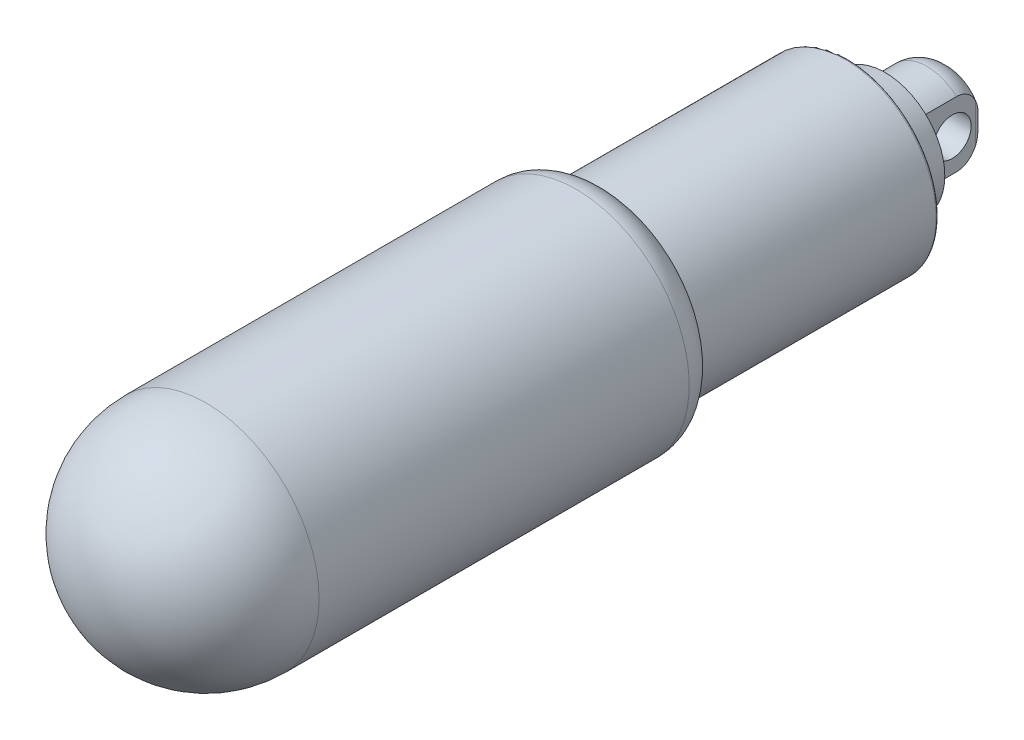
ISO-10303-21;
HEADER;
FILE_DESCRIPTION(('STEP AP214'),'2;1');
FILE_NAME('part.step','',(''),(''),'','','');
FILE_SCHEMA(('AUTOMOTIVE_DESIGN { 1 0 10303 214 1 1 1 1 }'));
ENDSEC;
DATA;
#1=APPLICATION_CONTEXT('core data for automotive mechanical design processes');
#2=APPLICATION_PROTOCOL_DEFINITION('international standard','automotive_design',2000,#1);
#3=PRODUCT_CONTEXT('',#1,'mechanical');
#4=PRODUCT('Part','Part','',(#3));
#5=PRODUCT_RELATED_PRODUCT_CATEGORY('part','',(#4));
#6=PRODUCT_DEFINITION_FORMATION('','',#4);
#7=PRODUCT_DEFINITION_CONTEXT('part definition',#1,'design');
#8=PRODUCT_DEFINITION('design','',#6,#7);
#9=PRODUCT_DEFINITION_SHAPE('','',#8);
#10=(LENGTH_UNIT() NAMED_UNIT(*) SI_UNIT(.MILLI.,.METRE.));
#11=(NAMED_UNIT(*) PLANE_ANGLE_UNIT() SI_UNIT($,.RADIAN.));
#12=(NAMED_UNIT(*) SI_UNIT($,.STERADIAN.) SOLID_ANGLE_UNIT());
#13=UNCERTAINTY_MEASURE_WITH_UNIT(LENGTH_MEASURE(1.E-05),#10,'distance_accuracy_value','');
#14=(GEOMETRIC_REPRESENTATION_CONTEXT(3) GLOBAL_UNCERTAINTY_ASSIGNED_CONTEXT((#13)) GLOBAL_UNIT_ASSIGNED_CONTEXT((#10,
#11,#12)) REPRESENTATION_CONTEXT('',''));
#15=CARTESIAN_POINT('',(0.,0.,0.));
#16=DIRECTION('',(0.,0.,1.));
#17=DIRECTION('',(1.,0.,0.));
#18=AXIS2_PLACEMENT_3D('',#15,#16,#17);
#19=CARTESIAN_POINT('',(0.,0.75,-2.3333333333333));
#20=DIRECTION('',(0.,0.,-1.));
#21=DIRECTION('',(0.,1.,0.));
#22=AXIS2_PLACEMENT_3D('',#19,#20,#21);
#23=PLANE('',#22);
#24=CARTESIAN_POINT('',(0.,0.,-2.3333333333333));
#25=DIRECTION('',(0.,0.,1.));
#26=DIRECTION('',(1.,0.,0.));
#27=AXIS2_PLACEMENT_3D('',#24,#25,#26);
#28=CIRCLE('',#27,1.5);
#29=CARTESIAN_POINT('',(1.5,0.,-2.3333333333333));
#30=VERTEX_POINT('',#29);
#31=CARTESIAN_POINT('',(0.,1.5,-2.3333333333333));
#32=VERTEX_POINT('',#31);
#33=EDGE_CURVE('E186',#30,#32,#28,.T.);
#34=ORIENTED_EDGE('',*,*,#33,.F.);
#35=CARTESIAN_POINT('',(0.,0.,-2.3333333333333));
#36=DIRECTION('',(0.,0.,1.));
#37=DIRECTION('',(-1.,0.,0.));
#38=AXIS2_PLACEMENT_3D('',#35,#36,#37);
#39=CIRCLE('',#38,1.5);
#40=CARTESIAN_POINT('',(-1.5,0.,-2.3333333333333));
#41=VERTEX_POINT('',#40);
#42=EDGE_CURVE('E81',#41,#30,#39,.T.);
#43=ORIENTED_EDGE('',*,*,#42,.F.);
#44=CARTESIAN_POINT('',(0.,0.,-2.3333333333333));
#45=DIRECTION('',(0.,0.,1.));
#46=DIRECTION('',(0.,1.,0.));
#47=AXIS2_PLACEMENT_3D('',#44,#45,#46);
#48=CIRCLE('',#47,1.5);
#49=EDGE_CURVE('E182',#32,#41,#48,.T.);
#50=ORIENTED_EDGE('',*,*,#49,.F.);
#51=EDGE_LOOP('',(#34,#43,#50));
#52=FACE_BOUND('',#51,.T.);
#53=ADVANCED_FACE('F14',(#52),#23,.T.);
#54=CARTESIAN_POINT('',(-1.85,-9.,-1.8333333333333));
#55=DIRECTION('',(0.,-1.,0.));
#56=DIRECTION('',(1.,0.,0.));
#57=AXIS2_PLACEMENT_3D('',#54,#55,#56);
#58=CYLINDRICAL_SURFACE('',#57,0.500000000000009);
#59=DIRECTION('',(0.,1.,0.));
#60=VECTOR('',#59,1.);
#61=CARTESIAN_POINT('',(-2.35,-9.,-1.8333333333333));
#62=LINE('',#61,#60);
#63=CARTESIAN_POINT('',(-2.35,-1.5640098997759,-1.8333333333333));
#64=VERTEX_POINT('',#63);
#65=CARTESIAN_POINT('',(-2.35,1.5640098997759,-1.8333333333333));
#66=VERTEX_POINT('',#65);
#67=EDGE_CURVE('E112',#64,#66,#62,.T.);
#68=ORIENTED_EDGE('',*,*,#67,.T.);
#69=CARTESIAN_POINT('',(-2.35,-1.5640098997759,-1.8333333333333));
#70=CARTESIAN_POINT('',(-2.35000059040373,-1.52921617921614,-1.85033683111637));
#71=CARTESIAN_POINT('',(-2.34913273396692,-1.49426464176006,-1.86699499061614));
#72=CARTESIAN_POINT('',(-2.34587423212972,-1.4240595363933,-1.89947718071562));
#73=CARTESIAN_POINT('',(-2.34348409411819,-1.38880607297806,-1.91530148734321));
#74=CARTESIAN_POINT('',(-2.33436002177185,-1.28269217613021,-1.96127595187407));
#75=CARTESIAN_POINT('',(-2.32567104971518,-1.21136632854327,-1.98998321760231));
#76=CARTESIAN_POINT('',(-2.30491634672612,-1.06739492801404,-2.0427532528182));
#77=CARTESIAN_POINT('',(-2.2928451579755,-0.994747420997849,-2.06680840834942));
#78=CARTESIAN_POINT('',(-2.26741048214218,-0.848150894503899,-2.10972121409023));
#79=CARTESIAN_POINT('',(-2.254047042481,-0.77420192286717,-2.1285790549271));
#80=CARTESIAN_POINT('',(-2.23371793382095,-0.656205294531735,-2.15412271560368));
#81=CARTESIAN_POINT('',(-2.22641554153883,-0.612597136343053,-2.16259953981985));
#82=CARTESIAN_POINT('',(-2.21262642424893,-0.524936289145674,-2.17772651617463));
#83=CARTESIAN_POINT('',(-2.2061396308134,-0.480883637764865,-2.18437682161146));
#84=CARTESIAN_POINT('',(-2.19444993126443,-0.392477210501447,-2.19585432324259));
#85=CARTESIAN_POINT('',(-2.18924403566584,-0.348124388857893,-2.20068577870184));
#86=CARTESIAN_POINT('',(-2.18049591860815,-0.259099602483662,-2.20857660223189));
#87=CARTESIAN_POINT('',(-2.17695342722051,-0.214427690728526,-2.21163625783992));
#88=CARTESIAN_POINT('',(-2.17276895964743,-0.141431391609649,-2.21520313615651));
#89=CARTESIAN_POINT('',(-2.17153891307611,-0.113164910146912,-2.2162357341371));
#90=CARTESIAN_POINT('',(-2.16989218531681,-0.0566002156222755,-2.21761158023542));
#91=CARTESIAN_POINT('',(-2.1694752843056,-0.0283020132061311,-2.2179550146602));
#92=CARTESIAN_POINT('',(-2.16948364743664,0.068259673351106,-2.21795563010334));
#93=CARTESIAN_POINT('',(-2.1719289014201,0.136541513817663,-2.21595938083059));
#94=CARTESIAN_POINT('',(-2.18123854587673,0.272585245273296,-2.20792078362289));
#95=CARTESIAN_POINT('',(-2.188106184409,0.340346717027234,-2.20187546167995));
#96=CARTESIAN_POINT('',(-2.2050464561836,0.475336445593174,-2.18558202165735));
#97=CARTESIAN_POINT('',(-2.21513705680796,0.542559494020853,-2.17531024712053));
#98=CARTESIAN_POINT('',(-2.23687971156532,0.675941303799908,-2.15050039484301));
#99=CARTESIAN_POINT('',(-2.24853171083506,0.742100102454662,-2.1359624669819));
#100=CARTESIAN_POINT('',(-2.27165531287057,0.872912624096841,-2.10279970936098));
#101=CARTESIAN_POINT('',(-2.28312760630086,0.937573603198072,-2.08420392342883));
#102=CARTESIAN_POINT('',(-2.30445804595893,1.06589445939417,-2.04310545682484));
#103=CARTESIAN_POINT('',(-2.31431668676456,1.12955463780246,-2.0206039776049));
#104=CARTESIAN_POINT('',(-2.33098930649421,1.25551542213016,-1.97224765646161));
#105=CARTESIAN_POINT('',(-2.33782319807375,1.3178222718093,-1.94641623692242));
#106=CARTESIAN_POINT('',(-2.3473395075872,1.44158364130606,-1.89187345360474));
#107=CARTESIAN_POINT('',(-2.35001595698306,1.50303681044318,-1.86315801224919));
#108=CARTESIAN_POINT('',(-2.35,1.5640098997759,-1.8333333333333));
#109=B_SPLINE_CURVE_WITH_KNOTS('',3,(#69,#70,#71,#72,#73,#74,#75,#76,#77,#78,#79,#80,#81,#82,
#83,#84,#85,#86,#87,#88,#89,#90,#91,#92,#93,#94,#95,#96,#97,#98,#99,#100,#101,#102,#103,#104,
#105,#106,#107,#108),.UNSPECIFIED.,.F.,.F.,(4,2,2,2,2,2,2,2,2,2,2,2,2,2,2,2,2,2,2,4),(0.,
0.116151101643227,0.232263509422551,0.464114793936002,0.696342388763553,0.928561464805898,
1.06358517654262,1.19859755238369,1.33329176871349,1.46796412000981,1.5528811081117,
1.63777513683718,1.84252518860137,2.04742579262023,2.25348922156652,2.45954541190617,
2.66417250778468,2.86873676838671,3.07193354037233,3.27542175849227),.UNSPECIFIED.);
#110=EDGE_CURVE('E80',#64,#66,#109,.T.);
#111=ORIENTED_EDGE('',*,*,#110,.F.);
#112=EDGE_LOOP('',(#68,#111));
#113=FACE_BOUND('',#112,.T.);
#114=ADVANCED_FACE('F227',(#113),#58,.T.);
#115=CARTESIAN_POINT('',(9.,0.,0.));
#116=DIRECTION('',(1.,0.,0.));
#117=DIRECTION('',(0.,1.,0.));
#118=AXIS2_PLACEMENT_3D('',#115,#116,#117);
#119=CYLINDRICAL_SURFACE('',#118,1.5);
#120=CARTESIAN_POINT('',(2.35,0.,0.));
#121=DIRECTION('',(1.,0.,0.));
#122=DIRECTION('',(0.,1.,0.));
#123=AXIS2_PLACEMENT_3D('',#120,#121,#122);
#124=CIRCLE('',#123,1.5);
#125=CARTESIAN_POINT('',(2.35,1.5,0.));
#126=VERTEX_POINT('',#125);
#127=EDGE_CURVE('E92',#126,#126,#124,.T.);
#128=ORIENTED_EDGE('',*,*,#127,.T.);
#129=EDGE_LOOP('',(#128));
#130=FACE_BOUND('',#129,.T.);
#131=CARTESIAN_POINT('',(-2.35,0.,0.));
#132=DIRECTION('',(1.,0.,0.));
#133=DIRECTION('',(0.,1.,0.));
#134=AXIS2_PLACEMENT_3D('',#131,#132,#133);
#135=CIRCLE('',#134,1.5);
#136=CARTESIAN_POINT('',(-2.35,1.5,0.));
#137=VERTEX_POINT('',#136);
#138=EDGE_CURVE('E218',#137,#137,#135,.F.);
#139=ORIENTED_EDGE('',*,*,#138,.T.);
#140=EDGE_LOOP('',(#139));
#141=FACE_BOUND('',#140,.T.);
#142=ADVANCED_FACE('F241',(#130,#141),#119,.F.);
#143=CARTESIAN_POINT('',(1.85,-9.,-1.8333333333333));
#144=DIRECTION('',(0.,-1.,0.));
#145=DIRECTION('',(1.,0.,0.));
#146=AXIS2_PLACEMENT_3D('',#143,#144,#145);
#147=CYLINDRICAL_SURFACE('',#146,0.499999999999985);
#148=DIRECTION('',(0.,1.,0.));
#149=VECTOR('',#148,1.);
#150=CARTESIAN_POINT('',(2.35,-9.,-1.8333333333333));
#151=LINE('',#150,#149);
#152=CARTESIAN_POINT('',(2.35,1.5640098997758,-1.8333333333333));
#153=VERTEX_POINT('',#152);
#154=CARTESIAN_POINT('',(2.35,-1.56400989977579,-1.8333333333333));
#155=VERTEX_POINT('',#154);
#156=EDGE_CURVE('E77',#153,#155,#151,.F.);
#157=ORIENTED_EDGE('',*,*,#156,.T.);
#158=CARTESIAN_POINT('',(2.35,1.5640098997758,-1.8333333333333));
#159=CARTESIAN_POINT('',(2.35000059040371,1.52921617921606,-1.8503368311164));
#160=CARTESIAN_POINT('',(2.3491327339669,1.49426464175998,-1.86699499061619));
#161=CARTESIAN_POINT('',(2.34587423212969,1.42405953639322,-1.89947718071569));
#162=CARTESIAN_POINT('',(2.34348409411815,1.38880607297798,-1.91530148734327));
#163=CARTESIAN_POINT('',(2.33436002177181,1.28269217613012,-1.96127595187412));
#164=CARTESIAN_POINT('',(2.32567104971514,1.21136632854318,-1.98998321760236));
#165=CARTESIAN_POINT('',(2.30491634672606,1.06739492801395,-2.04275325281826));
#166=CARTESIAN_POINT('',(2.29284515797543,0.994747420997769,-2.06680840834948));
#167=CARTESIAN_POINT('',(2.26741048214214,0.848150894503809,-2.10972121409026));
#168=CARTESIAN_POINT('',(2.254047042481,0.774201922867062,-2.12857905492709));
#169=CARTESIAN_POINT('',(2.23371793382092,0.656205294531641,-2.15412271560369));
#170=CARTESIAN_POINT('',(2.22641554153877,0.612597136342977,-2.16259953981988));
#171=CARTESIAN_POINT('',(2.21262642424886,0.524936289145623,-2.17772651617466));
#172=CARTESIAN_POINT('',(2.20613963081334,0.480883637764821,-2.18437682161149));
#173=CARTESIAN_POINT('',(2.19444993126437,0.39247721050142,-2.19585432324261));
#174=CARTESIAN_POINT('',(2.18924403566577,0.348124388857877,-2.20068577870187));
#175=CARTESIAN_POINT('',(2.1804959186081,0.259099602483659,-2.20857660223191));
#176=CARTESIAN_POINT('',(2.1769534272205,0.214427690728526,-2.21163625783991));
#177=CARTESIAN_POINT('',(2.17276895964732,0.141431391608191,-2.21520313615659));
#178=CARTESIAN_POINT('',(2.17153891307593,0.113164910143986,-2.21623573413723));
#179=CARTESIAN_POINT('',(2.16989218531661,0.0566002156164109,-2.21761158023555));
#180=CARTESIAN_POINT('',(2.16947528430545,0.0283020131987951,-2.21795501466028));
#181=CARTESIAN_POINT('',(2.1694836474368,-0.0682596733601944,-2.21795563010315));
#182=CARTESIAN_POINT('',(2.17192890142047,-0.13654151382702,-2.21595938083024));
#183=CARTESIAN_POINT('',(2.18123854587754,-0.27258524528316,-2.20792078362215));
#184=CARTESIAN_POINT('',(2.18810618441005,-0.340346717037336,-2.20187546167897));
#185=CARTESIAN_POINT('',(2.20504645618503,-0.475336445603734,-2.18558202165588));
#186=CARTESIAN_POINT('',(2.21513705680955,-0.542559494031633,-2.1753102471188));
#187=CARTESIAN_POINT('',(2.23687971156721,-0.675941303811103,-2.1505003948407));
#188=CARTESIAN_POINT('',(2.24853171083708,-0.742100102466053,-2.13596246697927));
#189=CARTESIAN_POINT('',(2.27165531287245,-0.87291262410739,-2.10279970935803));
#190=CARTESIAN_POINT('',(2.28312760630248,-0.937573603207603,-2.08420392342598));
#191=CARTESIAN_POINT('',(2.30445804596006,-1.06589445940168,-2.04310545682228));
#192=CARTESIAN_POINT('',(2.31431668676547,-1.12955463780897,-2.02060397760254));
#193=CARTESIAN_POINT('',(2.3309893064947,-1.25551542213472,-1.97224765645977));
#194=CARTESIAN_POINT('',(2.33782319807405,-1.31782227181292,-1.94641623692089));
#195=CARTESIAN_POINT('',(2.34733950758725,-1.44158364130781,-1.89187345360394));
#196=CARTESIAN_POINT('',(2.35001595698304,-1.503036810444,-1.86315801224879));
#197=CARTESIAN_POINT('',(2.35,-1.56400989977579,-1.8333333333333));
#198=B_SPLINE_CURVE_WITH_KNOTS('',3,(#158,#159,#160,#161,#162,#163,#164,#165,#166,#167,#168,
#169,#170,#171,#172,#173,#174,#175,#176,#177,#178,#179,#180,#181,#182,#183,#184,#185,#186,#187,
#188,#189,#190,#191,#192,#193,#194,#195,#196,#197),.UNSPECIFIED.,.F.,.F.,(4,2,2,2,2,2,2,2,2,2,2,
2,2,2,2,2,2,2,2,4),(0.,0.116151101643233,0.232263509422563,0.464114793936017,0.696342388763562,
0.928561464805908,1.06358517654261,1.19859755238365,1.33329176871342,1.46796412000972,
1.55288110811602,1.6377751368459,1.84252518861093,2.04742579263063,2.25348922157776,
2.45954541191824,2.66417250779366,2.8687367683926,3.07193354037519,3.2754217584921),.UNSPECIFIED.);
#199=EDGE_CURVE('E73',#153,#155,#198,.T.);
#200=ORIENTED_EDGE('',*,*,#199,.F.);
#201=EDGE_LOOP('',(#157,#200));
#202=FACE_BOUND('',#201,.T.);
#203=ADVANCED_FACE('F75',(#202),#147,.T.);
#204=CARTESIAN_POINT('',(-1.5,0.,-0.3333333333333));
#205=DIRECTION('',(0.,-1.,0.));
#206=DIRECTION('',(-1.,0.,0.));
#207=AXIS2_PLACEMENT_3D('',#204,#205,#206);
#208=CIRCLE('',#207,2.);
#209=TRIMMED_CURVE('',#208,(PARAMETER_VALUE(-2.41885840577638)),
(PARAMETER_VALUE(2.41885840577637)),.T.,.PARAMETER.);
#210=CARTESIAN_POINT('',(0.,0.,-0.3333333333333));
#211=DIRECTION('',(0.,0.,1.));
#212=AXIS1_PLACEMENT('',#210,#211);
#213=SURFACE_OF_REVOLUTION('',#209,#212);
#214=ORIENTED_EDGE('',*,*,#49,.T.);
#215=ORIENTED_EDGE('',*,*,#42,.T.);
#216=ORIENTED_EDGE('',*,*,#33,.T.);
#217=EDGE_LOOP('',(#214,#215,#216));
#218=FACE_BOUND('',#217,.T.);
#219=CARTESIAN_POINT('',(-2.35,-2.5937424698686,-0.3333333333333));
#220=CARTESIAN_POINT('',(-2.35,-2.59375045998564,-0.377182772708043));
#221=CARTESIAN_POINT('',(-2.35,-2.59179672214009,-0.421028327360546));
#222=CARTESIAN_POINT('',(-2.35,-2.58402697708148,-0.508363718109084));
#223=CARTESIAN_POINT('',(-2.35,-2.57821207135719,-0.551853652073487));
#224=CARTESIAN_POINT('',(-2.35,-2.56281070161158,-0.637989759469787));
#225=CARTESIAN_POINT('',(-2.35,-2.55323878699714,-0.680638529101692));
#226=CARTESIAN_POINT('',(-2.35,-2.53044831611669,-0.764938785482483));
#227=CARTESIAN_POINT('',(-2.35,-2.51722965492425,-0.806590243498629));
#228=CARTESIAN_POINT('',(-2.35,-2.47233422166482,-0.929550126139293));
#229=CARTESIAN_POINT('',(-2.35,-2.43539328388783,-1.00899955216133));
#230=CARTESIAN_POINT('',(-2.35,-2.34912359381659,-1.16079487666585));
#231=CARTESIAN_POINT('',(-2.35,-2.29978962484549,-1.2331377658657));
#232=CARTESIAN_POINT('',(-2.35,-2.18890735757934,-1.3716343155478));
#233=CARTESIAN_POINT('',(-2.35,-2.12701431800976,-1.43751055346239));
#234=CARTESIAN_POINT('',(-2.35,-1.99429539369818,-1.55958499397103));
#235=CARTESIAN_POINT('',(-2.35,-1.92346279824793,-1.61577585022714));
#236=CARTESIAN_POINT('',(-2.35,-1.80388642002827,-1.69841652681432));
#237=CARTESIAN_POINT('',(-2.35,-1.75722498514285,-1.72795114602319));
#238=CARTESIAN_POINT('',(-2.35,-1.66198564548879,-1.78333397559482));
#239=CARTESIAN_POINT('',(-2.35,-1.61341530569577,-1.80919516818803));
#240=CARTESIAN_POINT('',(-2.35,-1.5640098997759,-1.8333333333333));
#241=B_SPLINE_CURVE_WITH_KNOTS('',3,(#219,#220,#221,#222,#223,#224,#225,#226,#227,#228,#229,
#230,#231,#232,#233,#234,#235,#236,#237,#238,#239,#240),.UNSPECIFIED.,.F.,.F.,(4,2,2,2,2,2,2,2,
2,2,4),(0.,0.131498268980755,0.262959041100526,0.393915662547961,0.524876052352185,
0.786389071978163,1.04801235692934,1.3181350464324,1.58846173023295,1.75398900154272,
1.91891589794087),.UNSPECIFIED.);
#242=CARTESIAN_POINT('',(-2.35,-2.5937424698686,-0.3333333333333));
#243=VERTEX_POINT('',#242);
#244=EDGE_CURVE('E115',#243,#64,#241,.T.);
#245=ORIENTED_EDGE('',*,*,#244,.T.);
#246=ORIENTED_EDGE('',*,*,#110,.T.);
#247=CARTESIAN_POINT('',(-2.35,1.5640098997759,-1.8333333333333));
#248=CARTESIAN_POINT('',(-2.34999999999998,1.61224710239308,-1.80976387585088));
#249=CARTESIAN_POINT('',(-2.34999999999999,1.65968111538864,-1.78455890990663));
#250=CARTESIAN_POINT('',(-2.35000000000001,1.75263202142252,-1.73072923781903));
#251=CARTESIAN_POINT('',(-2.35000000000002,1.79814677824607,-1.70210085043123));
#252=CARTESIAN_POINT('',(-2.34999999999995,1.931822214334,-1.61050564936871));
#253=CARTESIAN_POINT('',(-2.34999999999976,2.01641491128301,-1.54216140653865));
#254=CARTESIAN_POINT('',(-2.34999999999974,2.17273088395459,-1.39094225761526));
#255=CARTESIAN_POINT('',(-2.34999999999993,2.24436939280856,-1.30797819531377));
#256=CARTESIAN_POINT('',(-2.35000000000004,2.33849905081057,-1.17446663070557));
#257=CARTESIAN_POINT('',(-2.35000000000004,2.3676285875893,-1.1285094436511));
#258=CARTESIAN_POINT('',(-2.34999999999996,2.42107941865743,-1.0338889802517));
#259=CARTESIAN_POINT('',(-2.34999999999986,2.44540234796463,-0.98522663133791));
#260=CARTESIAN_POINT('',(-2.34999999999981,2.50099651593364,-0.857696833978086));
#261=CARTESIAN_POINT('',(-2.34999999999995,2.52853747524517,-0.777167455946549));
#262=CARTESIAN_POINT('',(-2.35000000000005,2.56964585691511,-0.612693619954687));
#263=CARTESIAN_POINT('',(-2.35000000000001,2.58323615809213,-0.528754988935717));
#264=CARTESIAN_POINT('',(-2.35,2.59096626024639,-0.425906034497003));
#265=CARTESIAN_POINT('',(-2.35,2.59200773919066,-0.407393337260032));
#266=CARTESIAN_POINT('',(-2.35,2.59339486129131,-0.370366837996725));
#267=CARTESIAN_POINT('',(-2.35,2.59374143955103,-0.351853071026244));
#268=CARTESIAN_POINT('',(-2.35,2.5937424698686,-0.3333333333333));
#269=B_SPLINE_CURVE_WITH_KNOTS('',3,(#247,#248,#249,#250,#251,#252,#253,#254,#255,#256,#257,
#258,#259,#260,#261,#262,#263,#264,#265,#266,#267,#268),.UNSPECIFIED.,.F.,.F.,(4,2,2,2,2,2,2,2,
2,2,4),(0.,0.161012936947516,0.322200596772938,0.646874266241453,0.973601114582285,
1.13659305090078,1.29952944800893,1.55365932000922,1.80737175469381,1.86299068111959,
1.91853471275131),.UNSPECIFIED.);
#270=CARTESIAN_POINT('',(-2.35,2.5937424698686,-0.3333333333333));
#271=VERTEX_POINT('',#270);
#272=EDGE_CURVE('E111',#66,#271,#269,.T.);
#273=ORIENTED_EDGE('',*,*,#272,.T.);
#274=CARTESIAN_POINT('',(0.,0.,-0.3333333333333));
#275=DIRECTION('',(0.,0.,-1.));
#276=DIRECTION('',(-1.,0.,0.));
#277=AXIS2_PLACEMENT_3D('',#274,#275,#276);
#278=CIRCLE('',#277,3.5);
#279=CARTESIAN_POINT('',(2.35,2.5937424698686,-0.3333333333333));
#280=VERTEX_POINT('',#279);
#281=EDGE_CURVE('E88',#280,#271,#278,.F.);
#282=ORIENTED_EDGE('',*,*,#281,.F.);
#283=CARTESIAN_POINT('',(2.35,2.5937424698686,-0.3333333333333));
#284=CARTESIAN_POINT('',(2.35,2.59375045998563,-0.377182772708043));
#285=CARTESIAN_POINT('',(2.35,2.59179672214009,-0.421028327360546));
#286=CARTESIAN_POINT('',(2.35,2.58402697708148,-0.508363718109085));
#287=CARTESIAN_POINT('',(2.35,2.57821207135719,-0.551853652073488));
#288=CARTESIAN_POINT('',(2.35,2.56281070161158,-0.637989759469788));
#289=CARTESIAN_POINT('',(2.35,2.55323878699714,-0.680638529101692));
#290=CARTESIAN_POINT('',(2.35,2.53044831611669,-0.764938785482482));
#291=CARTESIAN_POINT('',(2.35,2.51722965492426,-0.806590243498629));
#292=CARTESIAN_POINT('',(2.35,2.47233422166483,-0.929550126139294));
#293=CARTESIAN_POINT('',(2.35,2.43539328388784,-1.00899955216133));
#294=CARTESIAN_POINT('',(2.35,2.34912359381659,-1.16079487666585));
#295=CARTESIAN_POINT('',(2.35,2.29978962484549,-1.23313776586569));
#296=CARTESIAN_POINT('',(2.35,2.18890735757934,-1.3716343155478));
#297=CARTESIAN_POINT('',(2.35,2.12701431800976,-1.43751055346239));
#298=CARTESIAN_POINT('',(2.35,1.99429539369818,-1.55958499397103));
#299=CARTESIAN_POINT('',(2.35,1.92346279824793,-1.61577585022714));
#300=CARTESIAN_POINT('',(2.35,1.80388642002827,-1.69841652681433));
#301=CARTESIAN_POINT('',(2.35,1.75722498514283,-1.72795114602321));
#302=CARTESIAN_POINT('',(2.35,1.66198564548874,-1.78333397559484));
#303=CARTESIAN_POINT('',(2.35,1.6134153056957,-1.80919516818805));
#304=CARTESIAN_POINT('',(2.35,1.5640098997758,-1.8333333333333));
#305=B_SPLINE_CURVE_WITH_KNOTS('',3,(#283,#284,#285,#286,#287,#288,#289,#290,#291,#292,#293,
#294,#295,#296,#297,#298,#299,#300,#301,#302,#303,#304),.UNSPECIFIED.,.F.,.F.,(4,2,2,2,2,2,2,2,
2,2,4),(0.,0.131498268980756,0.262959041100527,0.393915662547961,0.524876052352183,
0.786389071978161,1.04801235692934,1.3181350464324,1.58846173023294,1.75398900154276,
1.91891589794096),.UNSPECIFIED.);
#306=EDGE_CURVE('E84',#280,#153,#305,.T.);
#307=ORIENTED_EDGE('',*,*,#306,.T.);
#308=ORIENTED_EDGE('',*,*,#199,.T.);
#309=CARTESIAN_POINT('',(2.35,-1.56400989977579,-1.8333333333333));
#310=CARTESIAN_POINT('',(2.34999999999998,-1.61224710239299,-1.80976387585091));
#311=CARTESIAN_POINT('',(2.34999999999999,-1.65968111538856,-1.78455890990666));
#312=CARTESIAN_POINT('',(2.35000000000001,-1.75263202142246,-1.73072923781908));
#313=CARTESIAN_POINT('',(2.35000000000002,-1.79814677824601,-1.70210085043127));
#314=CARTESIAN_POINT('',(2.34999999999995,-1.93182221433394,-1.61050564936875));
#315=CARTESIAN_POINT('',(2.34999999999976,-2.01641491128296,-1.5421614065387));
#316=CARTESIAN_POINT('',(2.34999999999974,-2.17273088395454,-1.39094225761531));
#317=CARTESIAN_POINT('',(2.34999999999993,-2.24436939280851,-1.30797819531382));
#318=CARTESIAN_POINT('',(2.35000000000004,-2.33849905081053,-1.17446663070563));
#319=CARTESIAN_POINT('',(2.35000000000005,-2.36762858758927,-1.12850944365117));
#320=CARTESIAN_POINT('',(2.34999999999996,-2.42107941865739,-1.03388898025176));
#321=CARTESIAN_POINT('',(2.34999999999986,-2.44540234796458,-0.985226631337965));
#322=CARTESIAN_POINT('',(2.3499999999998,-2.50099651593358,-0.857696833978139));
#323=CARTESIAN_POINT('',(2.34999999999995,-2.52853747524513,-0.777167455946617));
#324=CARTESIAN_POINT('',(2.35000000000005,-2.56964585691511,-0.612693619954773));
#325=CARTESIAN_POINT('',(2.35000000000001,-2.58323615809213,-0.528754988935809));
#326=CARTESIAN_POINT('',(2.35,-2.59096626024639,-0.425906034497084));
#327=CARTESIAN_POINT('',(2.35,-2.59200773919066,-0.407393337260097));
#328=CARTESIAN_POINT('',(2.35,-2.59339486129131,-0.370366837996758));
#329=CARTESIAN_POINT('',(2.35,-2.59374143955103,-0.35185307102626));
#330=CARTESIAN_POINT('',(2.35,-2.5937424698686,-0.3333333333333));
#331=B_SPLINE_CURVE_WITH_KNOTS('',3,(#309,#310,#311,#312,#313,#314,#315,#316,#317,#318,#319,
#320,#321,#322,#323,#324,#325,#326,#327,#328,#329,#330),.UNSPECIFIED.,.F.,.F.,(4,2,2,2,2,2,2,2,
2,2,4),(0.,0.161012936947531,0.322200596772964,0.64687426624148,0.973601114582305,
1.1365930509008,1.29952944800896,1.55365932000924,1.8073717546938,1.86299068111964,
1.91853471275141),.UNSPECIFIED.);
#332=CARTESIAN_POINT('',(2.35,-2.5937424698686,-0.3333333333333));
#333=VERTEX_POINT('',#332);
#334=EDGE_CURVE('E98',#155,#333,#331,.T.);
#335=ORIENTED_EDGE('',*,*,#334,.T.);
#336=CARTESIAN_POINT('',(0.,0.,-0.3333333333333));
#337=DIRECTION('',(0.,0.,-1.));
#338=DIRECTION('',(-1.,0.,0.));
#339=AXIS2_PLACEMENT_3D('',#336,#337,#338);
#340=CIRCLE('',#339,3.5);
#341=EDGE_CURVE('E108',#243,#333,#340,.F.);
#342=ORIENTED_EDGE('',*,*,#341,.F.);
#343=EDGE_LOOP('',(#245,#246,#273,#282,#307,#308,#335,#342));
#344=FACE_BOUND('',#343,.T.);
#345=ADVANCED_FACE('F86',(#218,#344),#213,.F.);
#346=CARTESIAN_POINT('',(0.,0.,1.3333333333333));
#347=DIRECTION('',(0.,0.,-1.));
#348=DIRECTION('',(-1.,0.,0.));
#349=AXIS2_PLACEMENT_3D('',#346,#347,#348);
#350=CYLINDRICAL_SURFACE('',#349,3.5);
#351=DIRECTION('',(0.,0.,-1.));
#352=VECTOR('',#351,1.);
#353=CARTESIAN_POINT('',(-2.35,2.5937424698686,-1.8333333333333));
#354=LINE('',#353,#352);
#355=CARTESIAN_POINT('',(-2.35,2.5937424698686,3.));
#356=VERTEX_POINT('',#355);
#357=EDGE_CURVE('E109',#271,#356,#354,.F.);
#358=ORIENTED_EDGE('',*,*,#357,.T.);
#359=CARTESIAN_POINT('',(0.,0.,3.));
#360=DIRECTION('',(0.,0.,-1.));
#361=DIRECTION('',(-1.,0.,0.));
#362=AXIS2_PLACEMENT_3D('',#359,#360,#361);
#363=CIRCLE('',#362,3.5);
#364=CARTESIAN_POINT('',(2.35,2.5937424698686,3.));
#365=VERTEX_POINT('',#364);
#366=EDGE_CURVE('E324',#365,#356,#363,.F.);
#367=ORIENTED_EDGE('',*,*,#366,.F.);
#368=DIRECTION('',(0.,0.,1.));
#369=VECTOR('',#368,1.);
#370=CARTESIAN_POINT('',(2.35,2.5937424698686,3.));
#371=LINE('',#370,#369);
#372=EDGE_CURVE('E325',#365,#280,#371,.F.);
#373=ORIENTED_EDGE('',*,*,#372,.T.);
#374=ORIENTED_EDGE('',*,*,#281,.T.);
#375=EDGE_LOOP('',(#358,#367,#373,#374));
#376=FACE_BOUND('',#375,.T.);
#377=ADVANCED_FACE('F128',(#376),#350,.T.);
#378=CARTESIAN_POINT('',(-2.35,-9.,-1.8333333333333));
#379=DIRECTION('',(1.,0.,0.));
#380=DIRECTION('',(0.,0.,-1.));
#381=AXIS2_PLACEMENT_3D('',#378,#379,#380);
#382=PLANE('',#381);
#383=ORIENTED_EDGE('',*,*,#272,.F.);
#384=ORIENTED_EDGE('',*,*,#67,.F.);
#385=ORIENTED_EDGE('',*,*,#244,.F.);
#386=DIRECTION('',(0.,0.,-1.));
#387=VECTOR('',#386,1.);
#388=CARTESIAN_POINT('',(-2.35,-2.5937424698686,1.3333333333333));
#389=LINE('',#388,#387);
#390=CARTESIAN_POINT('',(-2.35,-2.5937424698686,3.));
#391=VERTEX_POINT('',#390);
#392=EDGE_CURVE('E105',#391,#243,#389,.T.);
#393=ORIENTED_EDGE('',*,*,#392,.F.);
#394=DIRECTION('',(0.,1.,0.));
#395=VECTOR('',#394,1.);
#396=CARTESIAN_POINT('',(-2.35,4.125,3.));
#397=LINE('',#396,#395);
#398=EDGE_CURVE('E322',#356,#391,#397,.F.);
#399=ORIENTED_EDGE('',*,*,#398,.F.);
#400=ORIENTED_EDGE('',*,*,#357,.F.);
#401=EDGE_LOOP('',(#383,#384,#385,#393,#399,#400));
#402=FACE_BOUND('',#401,.T.);
#403=ORIENTED_EDGE('',*,*,#138,.F.);
#404=EDGE_LOOP('',(#403));
#405=FACE_BOUND('',#404,.T.);
#406=ADVANCED_FACE('F229',(#402,#405),#382,.F.);
#407=CARTESIAN_POINT('',(0.,0.,1.3333333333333));
#408=DIRECTION('',(0.,0.,-1.));
#409=DIRECTION('',(-1.,0.,0.));
#410=AXIS2_PLACEMENT_3D('',#407,#408,#409);
#411=CYLINDRICAL_SURFACE('',#410,3.5);
#412=DIRECTION('',(0.,0.,1.));
#413=VECTOR('',#412,1.);
#414=CARTESIAN_POINT('',(2.35,-2.5937424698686,3.));
#415=LINE('',#414,#413);
#416=CARTESIAN_POINT('',(2.35,-2.5937424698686,3.));
#417=VERTEX_POINT('',#416);
#418=EDGE_CURVE('E100',#333,#417,#415,.T.);
#419=ORIENTED_EDGE('',*,*,#418,.T.);
#420=CARTESIAN_POINT('',(0.,0.,3.));
#421=DIRECTION('',(0.,0.,-1.));
#422=DIRECTION('',(-1.,0.,0.));
#423=AXIS2_PLACEMENT_3D('',#420,#421,#422);
#424=CIRCLE('',#423,3.5);
#425=EDGE_CURVE('E321',#391,#417,#424,.F.);
#426=ORIENTED_EDGE('',*,*,#425,.F.);
#427=ORIENTED_EDGE('',*,*,#392,.T.);
#428=ORIENTED_EDGE('',*,*,#341,.T.);
#429=EDGE_LOOP('',(#419,#426,#427,#428));
#430=FACE_BOUND('',#429,.T.);
#431=ADVANCED_FACE('F251',(#430),#411,.T.);
#432=CARTESIAN_POINT('',(2.35,-9.,3.));
#433=DIRECTION('',(-1.,0.,0.));
#434=DIRECTION('',(0.,0.,1.));
#435=AXIS2_PLACEMENT_3D('',#432,#433,#434);
#436=PLANE('',#435);
#437=DIRECTION('',(0.,1.,0.));
#438=VECTOR('',#437,1.);
#439=CARTESIAN_POINT('',(2.35,4.125,3.));
#440=LINE('',#439,#438);
#441=EDGE_CURVE('E312',#417,#365,#440,.T.);
#442=ORIENTED_EDGE('',*,*,#441,.F.);
#443=ORIENTED_EDGE('',*,*,#418,.F.);
#444=ORIENTED_EDGE('',*,*,#334,.F.);
#445=ORIENTED_EDGE('',*,*,#156,.F.);
#446=ORIENTED_EDGE('',*,*,#306,.F.);
#447=ORIENTED_EDGE('',*,*,#372,.F.);
#448=EDGE_LOOP('',(#442,#443,#444,#445,#446,#447));
#449=FACE_BOUND('',#448,.T.);
#450=ORIENTED_EDGE('',*,*,#127,.F.);
#451=EDGE_LOOP('',(#450));
#452=FACE_BOUND('',#451,.T.);
#453=ADVANCED_FACE('F95',(#449,#452),#436,.F.);
#454=CARTESIAN_POINT('',(0.,4.125,3.));
#455=DIRECTION('',(0.,0.,-1.));
#456=DIRECTION('',(-1.,0.,0.));
#457=AXIS2_PLACEMENT_3D('',#454,#455,#456);
#458=PLANE('',#457);
#459=CARTESIAN_POINT('',(0.,0.,2.9999999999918));
#460=DIRECTION('',(0.,0.,1.));
#461=DIRECTION('',(1.,0.,0.));
#462=AXIS2_PLACEMENT_3D('',#459,#460,#461);
#463=CIRCLE('',#462,4.75000000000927);
#464=CARTESIAN_POINT('',(4.75000000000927,0.,2.9999999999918));
#465=VERTEX_POINT('',#464);
#466=EDGE_CURVE('E320',#465,#465,#463,.T.);
#467=ORIENTED_EDGE('',*,*,#466,.F.);
#468=EDGE_LOOP('',(#467));
#469=FACE_BOUND('',#468,.T.);
#470=ORIENTED_EDGE('',*,*,#425,.T.);
#471=ORIENTED_EDGE('',*,*,#441,.T.);
#472=ORIENTED_EDGE('',*,*,#366,.T.);
#473=ORIENTED_EDGE('',*,*,#398,.T.);
#474=EDGE_LOOP('',(#470,#471,#472,#473));
#475=FACE_BOUND('',#474,.T.);
#476=ADVANCED_FACE('F250',(#469,#475),#458,.T.);
#477=CARTESIAN_POINT('',(0.,0.,5.99999999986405));
#478=DIRECTION('',(0.,0.,1.));
#479=DIRECTION('',(1.,0.,0.));
#480=AXIS2_PLACEMENT_3D('',#477,#478,#479);
#481=CONICAL_SURFACE('',#480,5.17162250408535,0.139626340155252);
#482=CARTESIAN_POINT('',(0.,0.,5.9999999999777));
#483=DIRECTION('',(0.,0.,1.));
#484=DIRECTION('',(1.,0.,0.));
#485=AXIS2_PLACEMENT_3D('',#482,#483,#484);
#486=CIRCLE('',#485,5.17162250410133);
#487=CARTESIAN_POINT('',(5.17162250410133,0.,5.9999999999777));
#488=VERTEX_POINT('',#487);
#489=EDGE_CURVE('E333',#488,#488,#486,.T.);
#490=ORIENTED_EDGE('',*,*,#489,.F.);
#491=EDGE_LOOP('',(#490));
#492=FACE_BOUND('',#491,.T.);
#493=ORIENTED_EDGE('',*,*,#466,.T.);
#494=EDGE_LOOP('',(#493));
#495=FACE_BOUND('',#494,.T.);
#496=ADVANCED_FACE('F395',(#492,#495),#481,.T.);
#497=CARTESIAN_POINT('',(0.,6.1138112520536,6.));
#498=DIRECTION('',(0.,0.,-1.));
#499=DIRECTION('',(0.,1.,0.));
#500=AXIS2_PLACEMENT_3D('',#497,#498,#499);
#501=PLANE('',#500);
#502=ORIENTED_EDGE('',*,*,#489,.T.);
#503=EDGE_LOOP('',(#502));
#504=FACE_BOUND('',#503,.T.);
#505=CARTESIAN_POINT('',(0.,0.,6.));
#506=DIRECTION('',(0.,0.,1.));
#507=DIRECTION('',(1.,0.,0.));
#508=AXIS2_PLACEMENT_3D('',#505,#506,#507);
#509=CIRCLE('',#508,7.056);
#510=CARTESIAN_POINT('',(7.056,0.,6.));
#511=VERTEX_POINT('',#510);
#512=CARTESIAN_POINT('',(0.,7.056,6.));
#513=VERTEX_POINT('',#512);
#514=EDGE_CURVE('E339',#511,#513,#509,.T.);
#515=ORIENTED_EDGE('',*,*,#514,.F.);
#516=CARTESIAN_POINT('',(0.,0.,6.));
#517=DIRECTION('',(0.,0.,1.));
#518=DIRECTION('',(-1.,0.,0.));
#519=AXIS2_PLACEMENT_3D('',#516,#517,#518);
#520=CIRCLE('',#519,7.056);
#521=CARTESIAN_POINT('',(-7.056,0.,6.));
#522=VERTEX_POINT('',#521);
#523=EDGE_CURVE('E335',#522,#511,#520,.T.);
#524=ORIENTED_EDGE('',*,*,#523,.F.);
#525=CARTESIAN_POINT('',(0.,0.,6.));
#526=DIRECTION('',(0.,0.,1.));
#527=DIRECTION('',(0.,1.,0.));
#528=AXIS2_PLACEMENT_3D('',#525,#526,#527);
#529=CIRCLE('',#528,7.056);
#530=EDGE_CURVE('E344',#513,#522,#529,.T.);
#531=ORIENTED_EDGE('',*,*,#530,.F.);
#532=EDGE_LOOP('',(#515,#524,#531));
#533=FACE_BOUND('',#532,.T.);
#534=ADVANCED_FACE('F297',(#504,#533),#501,.T.);
#535=CARTESIAN_POINT('',(0.,0.,6.2));
#536=DIRECTION('',(0.,0.,1.));
#537=DIRECTION('',(-1.,0.,0.));
#538=AXIS2_PLACEMENT_3D('',#535,#536,#537);
#539=TOROIDAL_SURFACE('',#538,7.056,0.2);
#540=CARTESIAN_POINT('',(0.,0.,6.2));
#541=DIRECTION('',(0.,0.,-1.));
#542=DIRECTION('',(-1.,0.,0.));
#543=AXIS2_PLACEMENT_3D('',#540,#541,#542);
#544=CIRCLE('',#543,7.256);
#545=CARTESIAN_POINT('',(-7.256,0.,6.2));
#546=VERTEX_POINT('',#545);
#547=EDGE_CURVE('E287',#546,#546,#544,.F.);
#548=ORIENTED_EDGE('',*,*,#547,.F.);
#549=EDGE_LOOP('',(#548));
#550=FACE_BOUND('',#549,.T.);
#551=ORIENTED_EDGE('',*,*,#514,.T.);
#552=ORIENTED_EDGE('',*,*,#530,.T.);
#553=ORIENTED_EDGE('',*,*,#523,.T.);
#554=EDGE_LOOP('',(#551,#552,#553));
#555=FACE_BOUND('',#554,.T.);
#556=ADVANCED_FACE('F292',(#550,#555),#539,.T.);
#557=CARTESIAN_POINT('',(0.,0.,15.6681779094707));
#558=DIRECTION('',(0.,0.,-1.));
#559=DIRECTION('',(-1.,0.,0.));
#560=AXIS2_PLACEMENT_3D('',#557,#558,#559);
#561=CYLINDRICAL_SURFACE('',#560,7.256);
#562=CARTESIAN_POINT('',(0.,0.,25.1363558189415));
#563=DIRECTION('',(0.,0.,1.));
#564=DIRECTION('',(-1.,0.,0.));
#565=AXIS2_PLACEMENT_3D('',#562,#563,#564);
#566=CIRCLE('',#565,7.256);
#567=CARTESIAN_POINT('',(-7.256,0.,25.1363558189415));
#568=VERTEX_POINT('',#567);
#569=EDGE_CURVE('E284',#568,#568,#566,.T.);
#570=ORIENTED_EDGE('',*,*,#569,.F.);
#571=EDGE_LOOP('',(#570));
#572=FACE_BOUND('',#571,.T.);
#573=ORIENTED_EDGE('',*,*,#547,.T.);
#574=EDGE_LOOP('',(#573));
#575=FACE_BOUND('',#574,.T.);
#576=ADVANCED_FACE('F296',(#572,#575),#561,.T.);
#577=CARTESIAN_POINT('',(0.,0.,27.57));
#578=DIRECTION('',(0.,0.,1.));
#579=DIRECTION('',(-1.,0.,0.));
#580=AXIS2_PLACEMENT_3D('',#577,#578,#579);
#581=TOROIDAL_SURFACE('',#580,6.43,2.57);
#582=ORIENTED_EDGE('',*,*,#569,.T.);
#583=EDGE_LOOP('',(#582));
#584=FACE_BOUND('',#583,.T.);
#585=CARTESIAN_POINT('',(0.,0.,27.57));
#586=DIRECTION('',(0.,0.,-1.));
#587=DIRECTION('',(-1.,0.,0.));
#588=AXIS2_PLACEMENT_3D('',#585,#586,#587);
#589=CIRCLE('',#588,9.);
#590=CARTESIAN_POINT('',(-9.,0.,27.57));
#591=VERTEX_POINT('',#590);
#592=EDGE_CURVE('E26',#591,#591,#589,.F.);
#593=ORIENTED_EDGE('',*,*,#592,.F.);
#594=EDGE_LOOP('',(#593));
#595=FACE_BOUND('',#594,.T.);
#596=ADVANCED_FACE('F270',(#584,#595),#581,.T.);
#597=CARTESIAN_POINT('',(0.,0.,57.));
#598=DIRECTION('',(0.,0.,1.));
#599=DIRECTION('',(0.,-1.,0.));
#600=AXIS2_PLACEMENT_3D('',#597,#598,#599);
#601=SPHERICAL_SURFACE('',#600,9.);
#602=CARTESIAN_POINT('',(0.,0.,66.));
#603=VERTEX_POINT('',#602);
#604=VERTEX_LOOP('',#603);
#605=FACE_BOUND('',#604,.T.);
#606=CARTESIAN_POINT('',(0.,0.,57.));
#607=DIRECTION('',(0.,0.,-1.));
#608=DIRECTION('',(-1.,0.,0.));
#609=AXIS2_PLACEMENT_3D('',#606,#607,#608);
#610=CIRCLE('',#609,9.);
#611=CARTESIAN_POINT('',(-9.,0.,57.));
#612=VERTEX_POINT('',#611);
#613=EDGE_CURVE('E9',#612,#612,#610,.T.);
#614=ORIENTED_EDGE('',*,*,#613,.F.);
#615=EDGE_LOOP('',(#614));
#616=FACE_BOUND('',#615,.T.);
#617=ADVANCED_FACE('F263',(#605,#616),#601,.T.);
#618=CARTESIAN_POINT('',(0.,0.,42.285));
#619=DIRECTION('',(0.,0.,-1.));
#620=DIRECTION('',(-1.,0.,0.));
#621=AXIS2_PLACEMENT_3D('',#618,#619,#620);
#622=CYLINDRICAL_SURFACE('',#621,9.);
#623=ORIENTED_EDGE('',*,*,#592,.T.);
#624=EDGE_LOOP('',(#623));
#625=FACE_BOUND('',#624,.T.);
#626=ORIENTED_EDGE('',*,*,#613,.T.);
#627=EDGE_LOOP('',(#626));
#628=FACE_BOUND('',#627,.T.);
#629=ADVANCED_FACE('F261',(#625,#628),#622,.T.);
#630=CLOSED_SHELL('',(#53,#114,#142,#203,#345,#377,#406,#431,#453,#476,#496,#534,#556,#576,#596,
#617,#629));
#631=MANIFOLD_SOLID_BREP('B1',#630);
#632=ADVANCED_BREP_SHAPE_REPRESENTATION('',(#18,#631),#14);
#633=SHAPE_DEFINITION_REPRESENTATION(#9,#632);
ENDSEC;
END-ISO-10303-21;
